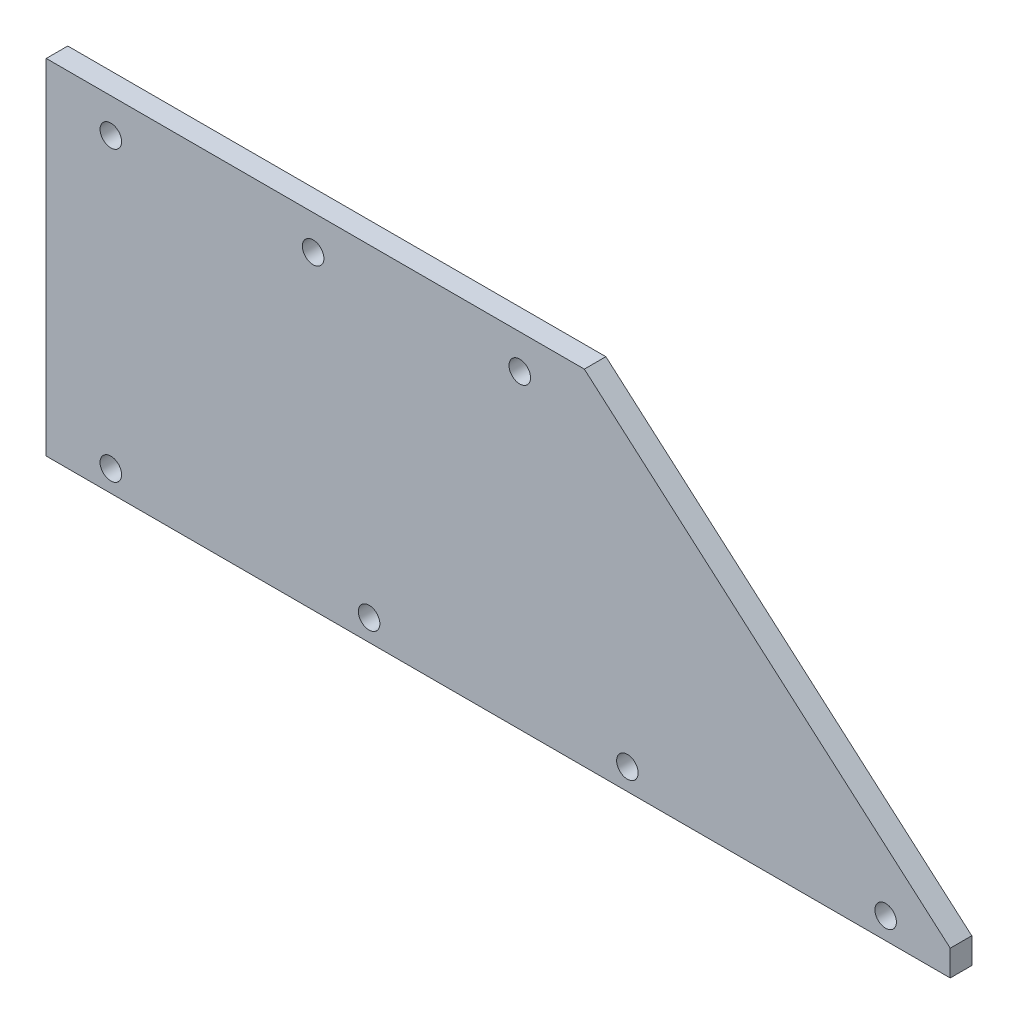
ISO-10303-21;
HEADER;
FILE_DESCRIPTION(('STEP AP214'),'2;1');
FILE_NAME('part.step','',(''),(''),'','','');
FILE_SCHEMA(('AUTOMOTIVE_DESIGN { 1 0 10303 214 1 1 1 1 }'));
ENDSEC;
DATA;
#1=APPLICATION_CONTEXT('core data for automotive mechanical design processes');
#2=APPLICATION_PROTOCOL_DEFINITION('international standard','automotive_design',2000,#1);
#3=PRODUCT_CONTEXT('',#1,'mechanical');
#4=PRODUCT('Part','Part','',(#3));
#5=PRODUCT_RELATED_PRODUCT_CATEGORY('part','',(#4));
#6=PRODUCT_DEFINITION_FORMATION('','',#4);
#7=PRODUCT_DEFINITION_CONTEXT('part definition',#1,'design');
#8=PRODUCT_DEFINITION('design','',#6,#7);
#9=PRODUCT_DEFINITION_SHAPE('','',#8);
#10=(LENGTH_UNIT() NAMED_UNIT(*) SI_UNIT(.MILLI.,.METRE.));
#11=(NAMED_UNIT(*) PLANE_ANGLE_UNIT() SI_UNIT($,.RADIAN.));
#12=(NAMED_UNIT(*) SI_UNIT($,.STERADIAN.) SOLID_ANGLE_UNIT());
#13=UNCERTAINTY_MEASURE_WITH_UNIT(LENGTH_MEASURE(1.E-05),#10,'distance_accuracy_value','');
#14=(GEOMETRIC_REPRESENTATION_CONTEXT(3) GLOBAL_UNCERTAINTY_ASSIGNED_CONTEXT((#13)) GLOBAL_UNIT_ASSIGNED_CONTEXT((#10,
#11,#12)) REPRESENTATION_CONTEXT('',''));
#15=CARTESIAN_POINT('',(0.,0.,0.));
#16=DIRECTION('',(0.,0.,1.));
#17=DIRECTION('',(1.,0.,0.));
#18=AXIS2_PLACEMENT_3D('',#15,#16,#17);
#19=CARTESIAN_POINT('',(0.,0.,3.175));
#20=DIRECTION('',(0.,0.,1.));
#21=DIRECTION('',(1.,0.,0.));
#22=AXIS2_PLACEMENT_3D('',#19,#20,#21);
#23=PLANE('',#22);
#24=CARTESIAN_POINT('',(171.45,6.35000000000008,3.175));
#25=DIRECTION('',(0.,0.,1.));
#26=DIRECTION('',(1.,0.,0.));
#27=AXIS2_PLACEMENT_3D('',#24,#25,#26);
#28=CIRCLE('',#27,3.175);
#29=CARTESIAN_POINT('',(174.625,6.35000000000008,3.175));
#30=VERTEX_POINT('',#29);
#31=EDGE_CURVE('E183',#30,#30,#28,.T.);
#32=ORIENTED_EDGE('',*,*,#31,.F.);
#33=EDGE_LOOP('',(#32));
#34=FACE_BOUND('',#33,.T.);
#35=CARTESIAN_POINT('',(139.7,91.44,3.175));
#36=DIRECTION('',(0.,0.,1.));
#37=DIRECTION('',(1.,0.,0.));
#38=AXIS2_PLACEMENT_3D('',#35,#36,#37);
#39=CIRCLE('',#38,3.17499999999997);
#40=CARTESIAN_POINT('',(142.875,91.44,3.175));
#41=VERTEX_POINT('',#40);
#42=EDGE_CURVE('E195',#41,#41,#39,.T.);
#43=ORIENTED_EDGE('',*,*,#42,.F.);
#44=EDGE_LOOP('',(#43));
#45=FACE_BOUND('',#44,.T.);
#46=CARTESIAN_POINT('',(19.05,91.44,3.175));
#47=DIRECTION('',(0.,0.,1.));
#48=DIRECTION('',(1.,0.,0.));
#49=AXIS2_PLACEMENT_3D('',#46,#47,#48);
#50=CIRCLE('',#49,3.175);
#51=CARTESIAN_POINT('',(22.225,91.44,3.175));
#52=VERTEX_POINT('',#51);
#53=EDGE_CURVE('E207',#52,#52,#50,.T.);
#54=ORIENTED_EDGE('',*,*,#53,.F.);
#55=EDGE_LOOP('',(#54));
#56=FACE_BOUND('',#55,.T.);
#57=DIRECTION('',(0.,-1.,0.));
#58=VECTOR('',#57,1.);
#59=CARTESIAN_POINT('',(0.,101.6,3.175));
#60=LINE('',#59,#58);
#61=CARTESIAN_POINT('',(0.,101.6,3.175));
#62=VERTEX_POINT('',#61);
#63=CARTESIAN_POINT('',(0.,0.,3.175));
#64=VERTEX_POINT('',#63);
#65=EDGE_CURVE('E116',#62,#64,#60,.T.);
#66=ORIENTED_EDGE('',*,*,#65,.T.);
#67=DIRECTION('',(1.,0.,0.));
#68=VECTOR('',#67,1.);
#69=CARTESIAN_POINT('',(0.,0.,3.175));
#70=LINE('',#69,#68);
#71=CARTESIAN_POINT('',(266.7,0.,3.175));
#72=VERTEX_POINT('',#71);
#73=EDGE_CURVE('E83',#64,#72,#70,.T.);
#74=ORIENTED_EDGE('',*,*,#73,.T.);
#75=DIRECTION('',(0.,1.,0.));
#76=VECTOR('',#75,1.);
#77=CARTESIAN_POINT('',(266.7,0.,3.175));
#78=LINE('',#77,#76);
#79=CARTESIAN_POINT('',(266.7,7.62,3.175));
#80=VERTEX_POINT('',#79);
#81=EDGE_CURVE('E87',#72,#80,#78,.T.);
#82=ORIENTED_EDGE('',*,*,#81,.T.);
#83=DIRECTION('',(-0.754223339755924,0.656617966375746,0.));
#84=VECTOR('',#83,1.);
#85=CARTESIAN_POINT('',(266.7,7.62,3.175));
#86=LINE('',#85,#84);
#87=CARTESIAN_POINT('',(158.75,101.6,3.175));
#88=VERTEX_POINT('',#87);
#89=EDGE_CURVE('E91',#80,#88,#86,.T.);
#90=ORIENTED_EDGE('',*,*,#89,.T.);
#91=DIRECTION('',(-1.,0.,0.));
#92=VECTOR('',#91,1.);
#93=CARTESIAN_POINT('',(158.75,101.6,3.175));
#94=LINE('',#93,#92);
#95=EDGE_CURVE('E49',#88,#62,#94,.T.);
#96=ORIENTED_EDGE('',*,*,#95,.T.);
#97=EDGE_LOOP('',(#66,#74,#82,#90,#96));
#98=FACE_BOUND('',#97,.T.);
#99=CARTESIAN_POINT('',(19.05,6.35000000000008,3.175));
#100=DIRECTION('',(0.,0.,1.));
#101=DIRECTION('',(1.,0.,0.));
#102=AXIS2_PLACEMENT_3D('',#99,#100,#101);
#103=CIRCLE('',#102,3.175);
#104=CARTESIAN_POINT('',(22.225,6.35000000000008,3.175));
#105=VERTEX_POINT('',#104);
#106=EDGE_CURVE('E111',#105,#105,#103,.T.);
#107=ORIENTED_EDGE('',*,*,#106,.F.);
#108=EDGE_LOOP('',(#107));
#109=FACE_BOUND('',#108,.T.);
#110=CARTESIAN_POINT('',(78.74,91.44,3.175));
#111=DIRECTION('',(0.,0.,1.));
#112=DIRECTION('',(1.,0.,0.));
#113=AXIS2_PLACEMENT_3D('',#110,#111,#112);
#114=CIRCLE('',#113,3.175);
#115=CARTESIAN_POINT('',(81.915,91.44,3.175));
#116=VERTEX_POINT('',#115);
#117=EDGE_CURVE('E201',#116,#116,#114,.T.);
#118=ORIENTED_EDGE('',*,*,#117,.F.);
#119=EDGE_LOOP('',(#118));
#120=FACE_BOUND('',#119,.T.);
#121=CARTESIAN_POINT('',(95.25,6.35000000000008,3.175));
#122=DIRECTION('',(0.,0.,1.));
#123=DIRECTION('',(1.,0.,0.));
#124=AXIS2_PLACEMENT_3D('',#121,#122,#123);
#125=CIRCLE('',#124,3.175);
#126=CARTESIAN_POINT('',(98.425,6.35000000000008,3.175));
#127=VERTEX_POINT('',#126);
#128=EDGE_CURVE('E189',#127,#127,#125,.T.);
#129=ORIENTED_EDGE('',*,*,#128,.F.);
#130=EDGE_LOOP('',(#129));
#131=FACE_BOUND('',#130,.T.);
#132=CARTESIAN_POINT('',(247.65,6.35,3.175));
#133=DIRECTION('',(0.,0.,1.));
#134=DIRECTION('',(1.,0.,0.));
#135=AXIS2_PLACEMENT_3D('',#132,#133,#134);
#136=CIRCLE('',#135,3.17499999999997);
#137=CARTESIAN_POINT('',(250.825,6.35,3.175));
#138=VERTEX_POINT('',#137);
#139=EDGE_CURVE('E174',#138,#138,#136,.T.);
#140=ORIENTED_EDGE('',*,*,#139,.F.);
#141=EDGE_LOOP('',(#140));
#142=FACE_BOUND('',#141,.T.);
#143=ADVANCED_FACE('F32',(#34,#45,#56,#98,#109,#120,#131,#142),#23,.T.);
#144=CARTESIAN_POINT('',(0.,0.,-3.175));
#145=DIRECTION('',(0.,0.,1.));
#146=DIRECTION('',(1.,0.,0.));
#147=AXIS2_PLACEMENT_3D('',#144,#145,#146);
#148=PLANE('',#147);
#149=DIRECTION('',(0.,-1.,0.));
#150=VECTOR('',#149,1.);
#151=CARTESIAN_POINT('',(0.,101.6,-3.175));
#152=LINE('',#151,#150);
#153=CARTESIAN_POINT('',(0.,101.6,-3.175));
#154=VERTEX_POINT('',#153);
#155=CARTESIAN_POINT('',(0.,0.,-3.175));
#156=VERTEX_POINT('',#155);
#157=EDGE_CURVE('E107',#154,#156,#152,.T.);
#158=ORIENTED_EDGE('',*,*,#157,.F.);
#159=DIRECTION('',(-1.,0.,0.));
#160=VECTOR('',#159,1.);
#161=CARTESIAN_POINT('',(158.75,101.6,-3.175));
#162=LINE('',#161,#160);
#163=CARTESIAN_POINT('',(158.75,101.6,-3.175));
#164=VERTEX_POINT('',#163);
#165=EDGE_CURVE('E75',#164,#154,#162,.T.);
#166=ORIENTED_EDGE('',*,*,#165,.F.);
#167=DIRECTION('',(-0.754223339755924,0.656617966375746,0.));
#168=VECTOR('',#167,1.);
#169=CARTESIAN_POINT('',(266.7,7.62,-3.175));
#170=LINE('',#169,#168);
#171=CARTESIAN_POINT('',(266.7,7.62,-3.175));
#172=VERTEX_POINT('',#171);
#173=EDGE_CURVE('E69',#172,#164,#170,.T.);
#174=ORIENTED_EDGE('',*,*,#173,.F.);
#175=DIRECTION('',(0.,1.,0.));
#176=VECTOR('',#175,1.);
#177=CARTESIAN_POINT('',(266.7,0.,-3.175));
#178=LINE('',#177,#176);
#179=CARTESIAN_POINT('',(266.7,0.,-3.175));
#180=VERTEX_POINT('',#179);
#181=EDGE_CURVE('E98',#180,#172,#178,.T.);
#182=ORIENTED_EDGE('',*,*,#181,.F.);
#183=DIRECTION('',(1.,0.,0.));
#184=VECTOR('',#183,1.);
#185=CARTESIAN_POINT('',(0.,0.,-3.175));
#186=LINE('',#185,#184);
#187=EDGE_CURVE('E110',#156,#180,#186,.T.);
#188=ORIENTED_EDGE('',*,*,#187,.F.);
#189=EDGE_LOOP('',(#158,#166,#174,#182,#188));
#190=FACE_BOUND('',#189,.T.);
#191=CARTESIAN_POINT('',(19.05,6.35000000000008,-3.175));
#192=DIRECTION('',(0.,0.,1.));
#193=DIRECTION('',(1.,0.,0.));
#194=AXIS2_PLACEMENT_3D('',#191,#192,#193);
#195=CIRCLE('',#194,3.175);
#196=CARTESIAN_POINT('',(22.225,6.35000000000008,-3.175));
#197=VERTEX_POINT('',#196);
#198=EDGE_CURVE('E210',#197,#197,#195,.T.);
#199=ORIENTED_EDGE('',*,*,#198,.T.);
#200=EDGE_LOOP('',(#199));
#201=FACE_BOUND('',#200,.T.);
#202=CARTESIAN_POINT('',(19.05,91.44,-3.175));
#203=DIRECTION('',(0.,0.,1.));
#204=DIRECTION('',(1.,0.,0.));
#205=AXIS2_PLACEMENT_3D('',#202,#203,#204);
#206=CIRCLE('',#205,3.175);
#207=CARTESIAN_POINT('',(22.225,91.44,-3.175));
#208=VERTEX_POINT('',#207);
#209=EDGE_CURVE('E204',#208,#208,#206,.T.);
#210=ORIENTED_EDGE('',*,*,#209,.T.);
#211=EDGE_LOOP('',(#210));
#212=FACE_BOUND('',#211,.T.);
#213=CARTESIAN_POINT('',(78.74,91.44,-3.175));
#214=DIRECTION('',(0.,0.,1.));
#215=DIRECTION('',(1.,0.,0.));
#216=AXIS2_PLACEMENT_3D('',#213,#214,#215);
#217=CIRCLE('',#216,3.175);
#218=CARTESIAN_POINT('',(81.915,91.44,-3.175));
#219=VERTEX_POINT('',#218);
#220=EDGE_CURVE('E198',#219,#219,#217,.T.);
#221=ORIENTED_EDGE('',*,*,#220,.T.);
#222=EDGE_LOOP('',(#221));
#223=FACE_BOUND('',#222,.T.);
#224=CARTESIAN_POINT('',(139.7,91.44,-3.175));
#225=DIRECTION('',(0.,0.,1.));
#226=DIRECTION('',(1.,0.,0.));
#227=AXIS2_PLACEMENT_3D('',#224,#225,#226);
#228=CIRCLE('',#227,3.17499999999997);
#229=CARTESIAN_POINT('',(142.875,91.44,-3.175));
#230=VERTEX_POINT('',#229);
#231=EDGE_CURVE('E192',#230,#230,#228,.T.);
#232=ORIENTED_EDGE('',*,*,#231,.T.);
#233=EDGE_LOOP('',(#232));
#234=FACE_BOUND('',#233,.T.);
#235=CARTESIAN_POINT('',(95.25,6.35000000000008,-3.175));
#236=DIRECTION('',(0.,0.,1.));
#237=DIRECTION('',(1.,0.,0.));
#238=AXIS2_PLACEMENT_3D('',#235,#236,#237);
#239=CIRCLE('',#238,3.175);
#240=CARTESIAN_POINT('',(98.425,6.35000000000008,-3.175));
#241=VERTEX_POINT('',#240);
#242=EDGE_CURVE('E186',#241,#241,#239,.T.);
#243=ORIENTED_EDGE('',*,*,#242,.T.);
#244=EDGE_LOOP('',(#243));
#245=FACE_BOUND('',#244,.T.);
#246=CARTESIAN_POINT('',(171.45,6.35000000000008,-3.175));
#247=DIRECTION('',(0.,0.,1.));
#248=DIRECTION('',(1.,0.,0.));
#249=AXIS2_PLACEMENT_3D('',#246,#247,#248);
#250=CIRCLE('',#249,3.175);
#251=CARTESIAN_POINT('',(174.625,6.35000000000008,-3.175));
#252=VERTEX_POINT('',#251);
#253=EDGE_CURVE('E180',#252,#252,#250,.T.);
#254=ORIENTED_EDGE('',*,*,#253,.T.);
#255=EDGE_LOOP('',(#254));
#256=FACE_BOUND('',#255,.T.);
#257=CARTESIAN_POINT('',(247.65,6.35,-3.175));
#258=DIRECTION('',(0.,0.,1.));
#259=DIRECTION('',(1.,0.,0.));
#260=AXIS2_PLACEMENT_3D('',#257,#258,#259);
#261=CIRCLE('',#260,3.17499999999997);
#262=CARTESIAN_POINT('',(250.825,6.35,-3.175));
#263=VERTEX_POINT('',#262);
#264=EDGE_CURVE('E177',#263,#263,#261,.T.);
#265=ORIENTED_EDGE('',*,*,#264,.T.);
#266=EDGE_LOOP('',(#265));
#267=FACE_BOUND('',#266,.T.);
#268=ADVANCED_FACE('F120',(#190,#201,#212,#223,#234,#245,#256,#267),#148,.F.);
#269=CARTESIAN_POINT('',(0.,101.6,3.175));
#270=DIRECTION('',(1.,0.,0.));
#271=DIRECTION('',(0.,0.,-1.));
#272=AXIS2_PLACEMENT_3D('',#269,#270,#271);
#273=PLANE('',#272);
#274=ORIENTED_EDGE('',*,*,#157,.T.);
#275=DIRECTION('',(0.,0.,-1.));
#276=VECTOR('',#275,1.);
#277=CARTESIAN_POINT('',(0.,0.,3.175));
#278=LINE('',#277,#276);
#279=EDGE_CURVE('E11',#64,#156,#278,.T.);
#280=ORIENTED_EDGE('',*,*,#279,.F.);
#281=ORIENTED_EDGE('',*,*,#65,.F.);
#282=DIRECTION('',(0.,0.,-1.));
#283=VECTOR('',#282,1.);
#284=CARTESIAN_POINT('',(0.,101.6,3.175));
#285=LINE('',#284,#283);
#286=EDGE_CURVE('E103',#62,#154,#285,.T.);
#287=ORIENTED_EDGE('',*,*,#286,.T.);
#288=EDGE_LOOP('',(#274,#280,#281,#287));
#289=FACE_BOUND('',#288,.T.);
#290=ADVANCED_FACE('F34',(#289),#273,.F.);
#291=CARTESIAN_POINT('',(0.,0.,3.175));
#292=DIRECTION('',(0.,1.,0.));
#293=DIRECTION('',(0.,0.,1.));
#294=AXIS2_PLACEMENT_3D('',#291,#292,#293);
#295=PLANE('',#294);
#296=ORIENTED_EDGE('',*,*,#187,.T.);
#297=DIRECTION('',(0.,0.,-1.));
#298=VECTOR('',#297,1.);
#299=CARTESIAN_POINT('',(266.7,0.,3.175));
#300=LINE('',#299,#298);
#301=EDGE_CURVE('E41',#72,#180,#300,.T.);
#302=ORIENTED_EDGE('',*,*,#301,.F.);
#303=ORIENTED_EDGE('',*,*,#73,.F.);
#304=ORIENTED_EDGE('',*,*,#279,.T.);
#305=EDGE_LOOP('',(#296,#302,#303,#304));
#306=FACE_BOUND('',#305,.T.);
#307=ADVANCED_FACE('F286',(#306),#295,.F.);
#308=CARTESIAN_POINT('',(266.7,0.,3.175));
#309=DIRECTION('',(-1.,0.,0.));
#310=DIRECTION('',(0.,0.,1.));
#311=AXIS2_PLACEMENT_3D('',#308,#309,#310);
#312=PLANE('',#311);
#313=ORIENTED_EDGE('',*,*,#181,.T.);
#314=DIRECTION('',(0.,0.,-1.));
#315=VECTOR('',#314,1.);
#316=CARTESIAN_POINT('',(266.7,7.62,3.175));
#317=LINE('',#316,#315);
#318=EDGE_CURVE('E95',#80,#172,#317,.T.);
#319=ORIENTED_EDGE('',*,*,#318,.F.);
#320=ORIENTED_EDGE('',*,*,#81,.F.);
#321=ORIENTED_EDGE('',*,*,#301,.T.);
#322=EDGE_LOOP('',(#313,#319,#320,#321));
#323=FACE_BOUND('',#322,.T.);
#324=ADVANCED_FACE('F96',(#323),#312,.F.);
#325=CARTESIAN_POINT('',(266.7,7.62,3.175));
#326=DIRECTION('',(-0.656617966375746,-0.754223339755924,0.));
#327=DIRECTION('',(0.754223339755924,-0.656617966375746,0.));
#328=AXIS2_PLACEMENT_3D('',#325,#326,#327);
#329=PLANE('',#328);
#330=ORIENTED_EDGE('',*,*,#173,.T.);
#331=DIRECTION('',(0.,0.,-1.));
#332=VECTOR('',#331,1.);
#333=CARTESIAN_POINT('',(158.75,101.6,3.175));
#334=LINE('',#333,#332);
#335=EDGE_CURVE('E99',#88,#164,#334,.T.);
#336=ORIENTED_EDGE('',*,*,#335,.F.);
#337=ORIENTED_EDGE('',*,*,#89,.F.);
#338=ORIENTED_EDGE('',*,*,#318,.T.);
#339=EDGE_LOOP('',(#330,#336,#337,#338));
#340=FACE_BOUND('',#339,.T.);
#341=ADVANCED_FACE('F101',(#340),#329,.F.);
#342=CARTESIAN_POINT('',(158.75,101.6,3.175));
#343=DIRECTION('',(0.,-1.,0.));
#344=DIRECTION('',(1.,0.,0.));
#345=AXIS2_PLACEMENT_3D('',#342,#343,#344);
#346=PLANE('',#345);
#347=ORIENTED_EDGE('',*,*,#165,.T.);
#348=ORIENTED_EDGE('',*,*,#286,.F.);
#349=ORIENTED_EDGE('',*,*,#95,.F.);
#350=ORIENTED_EDGE('',*,*,#335,.T.);
#351=EDGE_LOOP('',(#347,#348,#349,#350));
#352=FACE_BOUND('',#351,.T.);
#353=ADVANCED_FACE('F125',(#352),#346,.F.);
#354=CARTESIAN_POINT('',(19.05,6.35000000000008,3.175));
#355=DIRECTION('',(0.,0.,-1.));
#356=DIRECTION('',(-1.,0.,0.));
#357=AXIS2_PLACEMENT_3D('',#354,#355,#356);
#358=CYLINDRICAL_SURFACE('',#357,3.175);
#359=ORIENTED_EDGE('',*,*,#106,.T.);
#360=EDGE_LOOP('',(#359));
#361=FACE_BOUND('',#360,.T.);
#362=ORIENTED_EDGE('',*,*,#198,.F.);
#363=EDGE_LOOP('',(#362));
#364=FACE_BOUND('',#363,.T.);
#365=ADVANCED_FACE('F127',(#361,#364),#358,.F.);
#366=CARTESIAN_POINT('',(19.05,91.44,3.175));
#367=DIRECTION('',(0.,0.,-1.));
#368=DIRECTION('',(-1.,0.,0.));
#369=AXIS2_PLACEMENT_3D('',#366,#367,#368);
#370=CYLINDRICAL_SURFACE('',#369,3.175);
#371=ORIENTED_EDGE('',*,*,#53,.T.);
#372=EDGE_LOOP('',(#371));
#373=FACE_BOUND('',#372,.T.);
#374=ORIENTED_EDGE('',*,*,#209,.F.);
#375=EDGE_LOOP('',(#374));
#376=FACE_BOUND('',#375,.T.);
#377=ADVANCED_FACE('F133',(#373,#376),#370,.F.);
#378=CARTESIAN_POINT('',(78.74,91.44,3.175));
#379=DIRECTION('',(0.,0.,-1.));
#380=DIRECTION('',(-1.,0.,0.));
#381=AXIS2_PLACEMENT_3D('',#378,#379,#380);
#382=CYLINDRICAL_SURFACE('',#381,3.175);
#383=ORIENTED_EDGE('',*,*,#117,.T.);
#384=EDGE_LOOP('',(#383));
#385=FACE_BOUND('',#384,.T.);
#386=ORIENTED_EDGE('',*,*,#220,.F.);
#387=EDGE_LOOP('',(#386));
#388=FACE_BOUND('',#387,.T.);
#389=ADVANCED_FACE('F149',(#385,#388),#382,.F.);
#390=CARTESIAN_POINT('',(139.7,91.44,3.175));
#391=DIRECTION('',(0.,0.,-1.));
#392=DIRECTION('',(-1.,0.,0.));
#393=AXIS2_PLACEMENT_3D('',#390,#391,#392);
#394=CYLINDRICAL_SURFACE('',#393,3.17499999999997);
#395=ORIENTED_EDGE('',*,*,#42,.T.);
#396=EDGE_LOOP('',(#395));
#397=FACE_BOUND('',#396,.T.);
#398=ORIENTED_EDGE('',*,*,#231,.F.);
#399=EDGE_LOOP('',(#398));
#400=FACE_BOUND('',#399,.T.);
#401=ADVANCED_FACE('F153',(#397,#400),#394,.F.);
#402=CARTESIAN_POINT('',(95.25,6.35000000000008,3.175));
#403=DIRECTION('',(0.,0.,-1.));
#404=DIRECTION('',(-1.,0.,0.));
#405=AXIS2_PLACEMENT_3D('',#402,#403,#404);
#406=CYLINDRICAL_SURFACE('',#405,3.175);
#407=ORIENTED_EDGE('',*,*,#128,.T.);
#408=EDGE_LOOP('',(#407));
#409=FACE_BOUND('',#408,.T.);
#410=ORIENTED_EDGE('',*,*,#242,.F.);
#411=EDGE_LOOP('',(#410));
#412=FACE_BOUND('',#411,.T.);
#413=ADVANCED_FACE('F157',(#409,#412),#406,.F.);
#414=CARTESIAN_POINT('',(171.45,6.35000000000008,3.175));
#415=DIRECTION('',(0.,0.,-1.));
#416=DIRECTION('',(-1.,0.,0.));
#417=AXIS2_PLACEMENT_3D('',#414,#415,#416);
#418=CYLINDRICAL_SURFACE('',#417,3.175);
#419=ORIENTED_EDGE('',*,*,#31,.T.);
#420=EDGE_LOOP('',(#419));
#421=FACE_BOUND('',#420,.T.);
#422=ORIENTED_EDGE('',*,*,#253,.F.);
#423=EDGE_LOOP('',(#422));
#424=FACE_BOUND('',#423,.T.);
#425=ADVANCED_FACE('F161',(#421,#424),#418,.F.);
#426=CARTESIAN_POINT('',(247.65,6.35,3.175));
#427=DIRECTION('',(0.,0.,-1.));
#428=DIRECTION('',(-1.,0.,0.));
#429=AXIS2_PLACEMENT_3D('',#426,#427,#428);
#430=CYLINDRICAL_SURFACE('',#429,3.17499999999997);
#431=ORIENTED_EDGE('',*,*,#139,.T.);
#432=EDGE_LOOP('',(#431));
#433=FACE_BOUND('',#432,.T.);
#434=ORIENTED_EDGE('',*,*,#264,.F.);
#435=EDGE_LOOP('',(#434));
#436=FACE_BOUND('',#435,.T.);
#437=ADVANCED_FACE('F165',(#433,#436),#430,.F.);
#438=CLOSED_SHELL('',(#143,#268,#290,#307,#324,#341,#353,#365,#377,#389,#401,#413,#425,#437));
#439=MANIFOLD_SOLID_BREP('B2',#438);
#440=ADVANCED_BREP_SHAPE_REPRESENTATION('',(#18,#439),#14);
#441=SHAPE_DEFINITION_REPRESENTATION(#9,#440);
ENDSEC;
END-ISO-10303-21;
